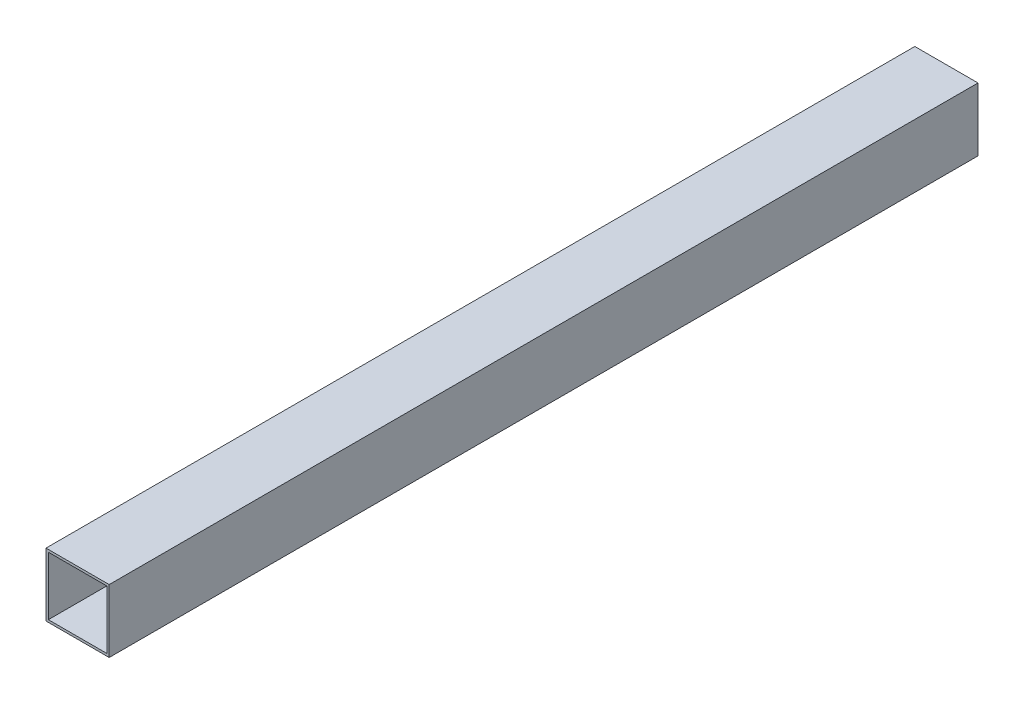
ISO-10303-21;
HEADER;
FILE_DESCRIPTION(('STEP AP214'),'2;1');
FILE_NAME('part.step','',(''),(''),'','','');
FILE_SCHEMA(('AUTOMOTIVE_DESIGN { 1 0 10303 214 1 1 1 1 }'));
ENDSEC;
DATA;
#1=APPLICATION_CONTEXT('core data for automotive mechanical design processes');
#2=APPLICATION_PROTOCOL_DEFINITION('international standard','automotive_design',2000,#1);
#3=PRODUCT_CONTEXT('',#1,'mechanical');
#4=PRODUCT('Part','Part','',(#3));
#5=PRODUCT_RELATED_PRODUCT_CATEGORY('part','',(#4));
#6=PRODUCT_DEFINITION_FORMATION('','',#4);
#7=PRODUCT_DEFINITION_CONTEXT('part definition',#1,'design');
#8=PRODUCT_DEFINITION('design','',#6,#7);
#9=PRODUCT_DEFINITION_SHAPE('','',#8);
#10=(LENGTH_UNIT() NAMED_UNIT(*) SI_UNIT(.MILLI.,.METRE.));
#11=(NAMED_UNIT(*) PLANE_ANGLE_UNIT() SI_UNIT($,.RADIAN.));
#12=(NAMED_UNIT(*) SI_UNIT($,.STERADIAN.) SOLID_ANGLE_UNIT());
#13=UNCERTAINTY_MEASURE_WITH_UNIT(LENGTH_MEASURE(1.E-05),#10,'distance_accuracy_value','');
#14=(GEOMETRIC_REPRESENTATION_CONTEXT(3) GLOBAL_UNCERTAINTY_ASSIGNED_CONTEXT((#13)) GLOBAL_UNIT_ASSIGNED_CONTEXT((#10,
#11,#12)) REPRESENTATION_CONTEXT('',''));
#15=CARTESIAN_POINT('',(0.,0.,0.));
#16=DIRECTION('',(0.,0.,1.));
#17=DIRECTION('',(1.,0.,0.));
#18=AXIS2_PLACEMENT_3D('',#15,#16,#17);
#19=CARTESIAN_POINT('',(0.,0.,1100.));
#20=DIRECTION('',(0.,0.,1.));
#21=DIRECTION('',(1.,0.,0.));
#22=AXIS2_PLACEMENT_3D('',#19,#20,#21);
#23=PLANE('',#22);
#24=DIRECTION('',(0.,-1.,0.));
#25=VECTOR('',#24,1.);
#26=CARTESIAN_POINT('',(0.,80.,1100.));
#27=LINE('',#26,#25);
#28=CARTESIAN_POINT('',(0.,80.,1100.));
#29=VERTEX_POINT('',#28);
#30=CARTESIAN_POINT('',(0.,0.,1100.));
#31=VERTEX_POINT('',#30);
#32=EDGE_CURVE('E141',#29,#31,#27,.T.);
#33=ORIENTED_EDGE('',*,*,#32,.T.);
#34=DIRECTION('',(1.,0.,0.));
#35=VECTOR('',#34,1.);
#36=CARTESIAN_POINT('',(0.,0.,1100.));
#37=LINE('',#36,#35);
#38=CARTESIAN_POINT('',(80.,0.,1100.));
#39=VERTEX_POINT('',#38);
#40=EDGE_CURVE('E144',#31,#39,#37,.T.);
#41=ORIENTED_EDGE('',*,*,#40,.T.);
#42=DIRECTION('',(0.,1.,0.));
#43=VECTOR('',#42,1.);
#44=CARTESIAN_POINT('',(80.,80.,1100.));
#45=LINE('',#44,#43);
#46=CARTESIAN_POINT('',(80.,80.,1100.));
#47=VERTEX_POINT('',#46);
#48=EDGE_CURVE('E146',#39,#47,#45,.T.);
#49=ORIENTED_EDGE('',*,*,#48,.T.);
#50=DIRECTION('',(-1.,0.,0.));
#51=VECTOR('',#50,1.);
#52=CARTESIAN_POINT('',(0.,80.,1100.));
#53=LINE('',#52,#51);
#54=EDGE_CURVE('E148',#47,#29,#53,.T.);
#55=ORIENTED_EDGE('',*,*,#54,.T.);
#56=EDGE_LOOP('',(#33,#41,#49,#55));
#57=FACE_BOUND('',#56,.T.);
#58=DIRECTION('',(1.,0.,0.));
#59=VECTOR('',#58,1.);
#60=CARTESIAN_POINT('',(3.,3.,1100.));
#61=LINE('',#60,#59);
#62=CARTESIAN_POINT('',(3.,3.,1100.));
#63=VERTEX_POINT('',#62);
#64=CARTESIAN_POINT('',(77.,3.,1100.));
#65=VERTEX_POINT('',#64);
#66=EDGE_CURVE('E123',#63,#65,#61,.T.);
#67=ORIENTED_EDGE('',*,*,#66,.F.);
#68=DIRECTION('',(0.,-1.,0.));
#69=VECTOR('',#68,1.);
#70=CARTESIAN_POINT('',(3.,77.,1100.));
#71=LINE('',#70,#69);
#72=CARTESIAN_POINT('',(3.,77.,1100.));
#73=VERTEX_POINT('',#72);
#74=EDGE_CURVE('E112',#73,#63,#71,.T.);
#75=ORIENTED_EDGE('',*,*,#74,.F.);
#76=DIRECTION('',(-1.,0.,0.));
#77=VECTOR('',#76,1.);
#78=CARTESIAN_POINT('',(3.,77.,1100.));
#79=LINE('',#78,#77);
#80=CARTESIAN_POINT('',(77.,77.,1100.));
#81=VERTEX_POINT('',#80);
#82=EDGE_CURVE('E127',#81,#73,#79,.T.);
#83=ORIENTED_EDGE('',*,*,#82,.F.);
#84=DIRECTION('',(0.,1.,0.));
#85=VECTOR('',#84,1.);
#86=CARTESIAN_POINT('',(77.,77.,1100.));
#87=LINE('',#86,#85);
#88=EDGE_CURVE('E125',#65,#81,#87,.T.);
#89=ORIENTED_EDGE('',*,*,#88,.F.);
#90=EDGE_LOOP('',(#67,#75,#83,#89));
#91=FACE_BOUND('',#90,.T.);
#92=ADVANCED_FACE('F32',(#57,#91),#23,.T.);
#93=CARTESIAN_POINT('',(0.,0.,0.));
#94=DIRECTION('',(0.,0.,1.));
#95=DIRECTION('',(1.,0.,0.));
#96=AXIS2_PLACEMENT_3D('',#93,#94,#95);
#97=PLANE('',#96);
#98=DIRECTION('',(0.,-1.,0.));
#99=VECTOR('',#98,1.);
#100=CARTESIAN_POINT('',(0.,80.,0.));
#101=LINE('',#100,#99);
#102=CARTESIAN_POINT('',(0.,80.,0.));
#103=VERTEX_POINT('',#102);
#104=CARTESIAN_POINT('',(0.,0.,0.));
#105=VERTEX_POINT('',#104);
#106=EDGE_CURVE('E113',#103,#105,#101,.T.);
#107=ORIENTED_EDGE('',*,*,#106,.F.);
#108=DIRECTION('',(-1.,0.,0.));
#109=VECTOR('',#108,1.);
#110=CARTESIAN_POINT('',(0.,80.,0.));
#111=LINE('',#110,#109);
#112=CARTESIAN_POINT('',(80.,80.,0.));
#113=VERTEX_POINT('',#112);
#114=EDGE_CURVE('E139',#113,#103,#111,.T.);
#115=ORIENTED_EDGE('',*,*,#114,.F.);
#116=DIRECTION('',(0.,1.,0.));
#117=VECTOR('',#116,1.);
#118=CARTESIAN_POINT('',(80.,80.,0.));
#119=LINE('',#118,#117);
#120=CARTESIAN_POINT('',(80.,0.,0.));
#121=VERTEX_POINT('',#120);
#122=EDGE_CURVE('E137',#121,#113,#119,.T.);
#123=ORIENTED_EDGE('',*,*,#122,.F.);
#124=DIRECTION('',(1.,0.,0.));
#125=VECTOR('',#124,1.);
#126=CARTESIAN_POINT('',(0.,0.,0.));
#127=LINE('',#126,#125);
#128=EDGE_CURVE('E135',#105,#121,#127,.T.);
#129=ORIENTED_EDGE('',*,*,#128,.F.);
#130=EDGE_LOOP('',(#107,#115,#123,#129));
#131=FACE_BOUND('',#130,.T.);
#132=DIRECTION('',(0.,-1.,0.));
#133=VECTOR('',#132,1.);
#134=CARTESIAN_POINT('',(3.,77.,0.));
#135=LINE('',#134,#133);
#136=CARTESIAN_POINT('',(3.,77.,0.));
#137=VERTEX_POINT('',#136);
#138=CARTESIAN_POINT('',(3.,3.,0.));
#139=VERTEX_POINT('',#138);
#140=EDGE_CURVE('E55',#137,#139,#135,.T.);
#141=ORIENTED_EDGE('',*,*,#140,.T.);
#142=DIRECTION('',(1.,0.,0.));
#143=VECTOR('',#142,1.);
#144=CARTESIAN_POINT('',(3.,3.,0.));
#145=LINE('',#144,#143);
#146=CARTESIAN_POINT('',(77.,3.,0.));
#147=VERTEX_POINT('',#146);
#148=EDGE_CURVE('E99',#139,#147,#145,.T.);
#149=ORIENTED_EDGE('',*,*,#148,.T.);
#150=DIRECTION('',(0.,1.,0.));
#151=VECTOR('',#150,1.);
#152=CARTESIAN_POINT('',(77.,77.,0.));
#153=LINE('',#152,#151);
#154=CARTESIAN_POINT('',(77.,77.,0.));
#155=VERTEX_POINT('',#154);
#156=EDGE_CURVE('E108',#147,#155,#153,.T.);
#157=ORIENTED_EDGE('',*,*,#156,.T.);
#158=DIRECTION('',(-1.,0.,0.));
#159=VECTOR('',#158,1.);
#160=CARTESIAN_POINT('',(3.,77.,0.));
#161=LINE('',#160,#159);
#162=EDGE_CURVE('E117',#155,#137,#161,.T.);
#163=ORIENTED_EDGE('',*,*,#162,.T.);
#164=EDGE_LOOP('',(#141,#149,#157,#163));
#165=FACE_BOUND('',#164,.T.);
#166=ADVANCED_FACE('F116',(#131,#165),#97,.F.);
#167=CARTESIAN_POINT('',(0.,80.,1100.));
#168=DIRECTION('',(1.,0.,0.));
#169=DIRECTION('',(0.,1.,0.));
#170=AXIS2_PLACEMENT_3D('',#167,#168,#169);
#171=PLANE('',#170);
#172=ORIENTED_EDGE('',*,*,#106,.T.);
#173=DIRECTION('',(0.,0.,-1.));
#174=VECTOR('',#173,1.);
#175=CARTESIAN_POINT('',(0.,0.,1100.));
#176=LINE('',#175,#174);
#177=EDGE_CURVE('E11',#31,#105,#176,.T.);
#178=ORIENTED_EDGE('',*,*,#177,.F.);
#179=ORIENTED_EDGE('',*,*,#32,.F.);
#180=DIRECTION('',(0.,0.,-1.));
#181=VECTOR('',#180,1.);
#182=CARTESIAN_POINT('',(0.,80.,1100.));
#183=LINE('',#182,#181);
#184=EDGE_CURVE('E150',#29,#103,#183,.T.);
#185=ORIENTED_EDGE('',*,*,#184,.T.);
#186=EDGE_LOOP('',(#172,#178,#179,#185));
#187=FACE_BOUND('',#186,.T.);
#188=ADVANCED_FACE('F34',(#187),#171,.F.);
#189=CARTESIAN_POINT('',(0.,0.,1100.));
#190=DIRECTION('',(0.,1.,0.));
#191=DIRECTION('',(0.,0.,1.));
#192=AXIS2_PLACEMENT_3D('',#189,#190,#191);
#193=PLANE('',#192);
#194=ORIENTED_EDGE('',*,*,#128,.T.);
#195=DIRECTION('',(0.,0.,-1.));
#196=VECTOR('',#195,1.);
#197=CARTESIAN_POINT('',(80.,0.,1100.));
#198=LINE('',#197,#196);
#199=EDGE_CURVE('E40',#39,#121,#198,.T.);
#200=ORIENTED_EDGE('',*,*,#199,.F.);
#201=ORIENTED_EDGE('',*,*,#40,.F.);
#202=ORIENTED_EDGE('',*,*,#177,.T.);
#203=EDGE_LOOP('',(#194,#200,#201,#202));
#204=FACE_BOUND('',#203,.T.);
#205=ADVANCED_FACE('F175',(#204),#193,.F.);
#206=CARTESIAN_POINT('',(80.,80.,1100.));
#207=DIRECTION('',(-1.,0.,0.));
#208=DIRECTION('',(0.,-1.,0.));
#209=AXIS2_PLACEMENT_3D('',#206,#207,#208);
#210=PLANE('',#209);
#211=ORIENTED_EDGE('',*,*,#122,.T.);
#212=DIRECTION('',(0.,0.,-1.));
#213=VECTOR('',#212,1.);
#214=CARTESIAN_POINT('',(80.,80.,1100.));
#215=LINE('',#214,#213);
#216=EDGE_CURVE('E153',#47,#113,#215,.T.);
#217=ORIENTED_EDGE('',*,*,#216,.F.);
#218=ORIENTED_EDGE('',*,*,#48,.F.);
#219=ORIENTED_EDGE('',*,*,#199,.T.);
#220=EDGE_LOOP('',(#211,#217,#218,#219));
#221=FACE_BOUND('',#220,.T.);
#222=ADVANCED_FACE('F160',(#221),#210,.F.);
#223=CARTESIAN_POINT('',(0.,80.,1100.));
#224=DIRECTION('',(0.,-1.,0.));
#225=DIRECTION('',(0.,0.,-1.));
#226=AXIS2_PLACEMENT_3D('',#223,#224,#225);
#227=PLANE('',#226);
#228=ORIENTED_EDGE('',*,*,#114,.T.);
#229=ORIENTED_EDGE('',*,*,#184,.F.);
#230=ORIENTED_EDGE('',*,*,#54,.F.);
#231=ORIENTED_EDGE('',*,*,#216,.T.);
#232=EDGE_LOOP('',(#228,#229,#230,#231));
#233=FACE_BOUND('',#232,.T.);
#234=ADVANCED_FACE('F168',(#233),#227,.F.);
#235=CARTESIAN_POINT('',(3.,77.,1100.));
#236=DIRECTION('',(1.,0.,0.));
#237=DIRECTION('',(0.,1.,0.));
#238=AXIS2_PLACEMENT_3D('',#235,#236,#237);
#239=PLANE('',#238);
#240=ORIENTED_EDGE('',*,*,#140,.F.);
#241=DIRECTION('',(0.,0.,-1.));
#242=VECTOR('',#241,1.);
#243=CARTESIAN_POINT('',(3.,77.,1100.));
#244=LINE('',#243,#242);
#245=EDGE_CURVE('E129',#73,#137,#244,.T.);
#246=ORIENTED_EDGE('',*,*,#245,.F.);
#247=ORIENTED_EDGE('',*,*,#74,.T.);
#248=DIRECTION('',(0.,0.,-1.));
#249=VECTOR('',#248,1.);
#250=CARTESIAN_POINT('',(3.,3.,1100.));
#251=LINE('',#250,#249);
#252=EDGE_CURVE('E101',#63,#139,#251,.T.);
#253=ORIENTED_EDGE('',*,*,#252,.T.);
#254=EDGE_LOOP('',(#240,#246,#247,#253));
#255=FACE_BOUND('',#254,.T.);
#256=ADVANCED_FACE('F110',(#255),#239,.T.);
#257=CARTESIAN_POINT('',(3.,3.,1100.));
#258=DIRECTION('',(0.,1.,0.));
#259=DIRECTION('',(0.,0.,1.));
#260=AXIS2_PLACEMENT_3D('',#257,#258,#259);
#261=PLANE('',#260);
#262=ORIENTED_EDGE('',*,*,#148,.F.);
#263=ORIENTED_EDGE('',*,*,#252,.F.);
#264=ORIENTED_EDGE('',*,*,#66,.T.);
#265=DIRECTION('',(0.,0.,-1.));
#266=VECTOR('',#265,1.);
#267=CARTESIAN_POINT('',(77.,3.,1100.));
#268=LINE('',#267,#266);
#269=EDGE_CURVE('E104',#65,#147,#268,.T.);
#270=ORIENTED_EDGE('',*,*,#269,.T.);
#271=EDGE_LOOP('',(#262,#263,#264,#270));
#272=FACE_BOUND('',#271,.T.);
#273=ADVANCED_FACE('F100',(#272),#261,.T.);
#274=CARTESIAN_POINT('',(77.,77.,1100.));
#275=DIRECTION('',(-1.,0.,0.));
#276=DIRECTION('',(0.,-1.,0.));
#277=AXIS2_PLACEMENT_3D('',#274,#275,#276);
#278=PLANE('',#277);
#279=ORIENTED_EDGE('',*,*,#156,.F.);
#280=ORIENTED_EDGE('',*,*,#269,.F.);
#281=ORIENTED_EDGE('',*,*,#88,.T.);
#282=DIRECTION('',(0.,0.,-1.));
#283=VECTOR('',#282,1.);
#284=CARTESIAN_POINT('',(77.,77.,1100.));
#285=LINE('',#284,#283);
#286=EDGE_CURVE('E47',#81,#155,#285,.T.);
#287=ORIENTED_EDGE('',*,*,#286,.T.);
#288=EDGE_LOOP('',(#279,#280,#281,#287));
#289=FACE_BOUND('',#288,.T.);
#290=ADVANCED_FACE('F197',(#289),#278,.T.);
#291=CARTESIAN_POINT('',(3.,77.,1100.));
#292=DIRECTION('',(0.,-1.,0.));
#293=DIRECTION('',(0.,0.,-1.));
#294=AXIS2_PLACEMENT_3D('',#291,#292,#293);
#295=PLANE('',#294);
#296=ORIENTED_EDGE('',*,*,#162,.F.);
#297=ORIENTED_EDGE('',*,*,#286,.F.);
#298=ORIENTED_EDGE('',*,*,#82,.T.);
#299=ORIENTED_EDGE('',*,*,#245,.T.);
#300=EDGE_LOOP('',(#296,#297,#298,#299));
#301=FACE_BOUND('',#300,.T.);
#302=ADVANCED_FACE('F202',(#301),#295,.T.);
#303=CLOSED_SHELL('',(#92,#166,#188,#205,#222,#234,#256,#273,#290,#302));
#304=MANIFOLD_SOLID_BREP('B2',#303);
#305=ADVANCED_BREP_SHAPE_REPRESENTATION('',(#18,#304),#14);
#306=SHAPE_DEFINITION_REPRESENTATION(#9,#305);
ENDSEC;
END-ISO-10303-21;
